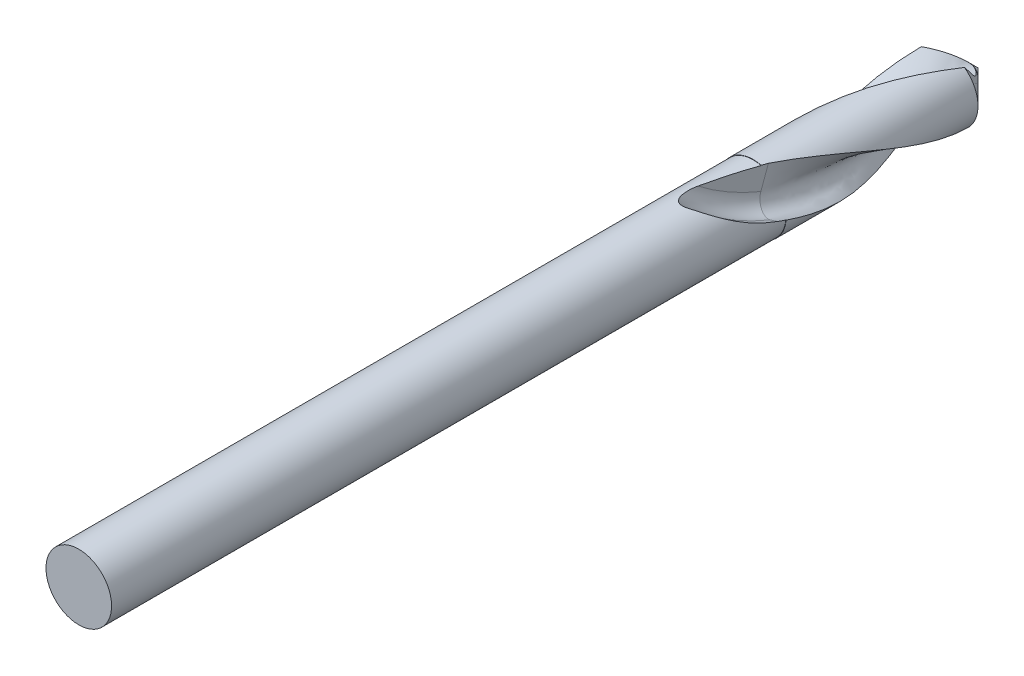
from build123d import *

# Parameters (mm, degrees)
FOPO_DENT_PITCH       = 8.63
FOPO_DENT_HEIGHT      = 3.9
FOPO_DENT_RADIUS      = 0.5
FOPO_DENT_START_ANGLE = 135
FOPO_DEG_ANGLE        = 90
REP_COUNT             = 2


with BuildPart() as part:
    # EsqCorps → CorpsOutil (revolve)
    with BuildSketch(Plane(origin=(0, 0, 0), x_dir=(0, 0, -1), z_dir=(1, 0, 0)), mode=Mode.PRIVATE) as corpsoutil_sk:
        Polygon((0, 0), (-13.6, 0), (-13.6, 0.496), (-3.4, 0.496), (-3.4, 0.5), (-0.5, 0.5), align=None)
    revolve(corpsoutil_sk.sketch.rotate(Axis((0, 0, 0.300640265), (0, 0, -1)), 180), axis=Axis((0, 0, 0.300640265), (0, 0, -1)))

    # FOPO-Dent: sweep along a helix
    with BuildLine() as fopo_dent_path:
        add(Helix(FOPO_DENT_PITCH, FOPO_DENT_HEIGHT, FOPO_DENT_RADIUS, center=(0, 0, 3.4), direction=(0, 0, -1), mode=Mode.PRIVATE).rotate(Axis((0, 0, 3.4), (0, 0, -1)), FOPO_DENT_START_ANGLE))
    # EsqDent → FOPO-Dent (sweep, cut)
    with BuildSketch(Plane(origin=(0.353553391, 0.353553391, 3.4), x_dir=(-0.9656323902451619, 0.03492966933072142, -0.25755388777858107), z_dir=(0.24188076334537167, -0.24188076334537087, -0.9396740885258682))):
        with BuildLine():
            Line((0.229053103, -0.236570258), (0.229053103, 0.618524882))
            ThreePointArc((0.229053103, 0.618524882), (-0.328822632, 0.37666394), (-0.643467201, -0.143644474))
            Line((-0.643467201, -0.143644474), (-0.05547055, -0.417831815))
            ThreePointArc((-0.05547055, -0.417831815), (0.136513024, -0.405248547), (0.229053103, -0.236570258))
        make_face()
    fopo_dent = sweep(path=fopo_dent_path.line, is_frenet=True, mode=Mode.SUBTRACT)

    # EsqDeg → FOPO-Deg (revolve, cut)
    with BuildSketch(Plane(origin=(0.353553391, 0.353553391, 3.4), x_dir=(-0.9656323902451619, 0.03492966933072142, -0.25755388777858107), z_dir=(0.24188076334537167, -0.24188076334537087, -0.9396740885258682))):
        with BuildLine():
            Line((0.229053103, -0.236570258), (0.229053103, 0.618524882))
            ThreePointArc((0.229053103, 0.618524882), (-0.328822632, 0.37666394), (-0.643467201, -0.143644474))
            Line((-0.643467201, -0.143644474), (-0.05547055, -0.417831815))
            ThreePointArc((-0.05547055, -0.417831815), (0.136513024, -0.405248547), (0.229053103, -0.236570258))
        make_face()
    fopo_deg = revolve(axis=Axis((1.696882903, 2.371413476, 3.226369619), (-0.9656323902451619, 0.034929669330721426, -0.25755388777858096)), revolution_arc=FOPO_DEG_ANGLE, mode=Mode.SUBTRACT)

    # Rep: FOPO-Dent, FOPO-Deg ×2 about axis
    rep_axis = Axis((0, 0, -1.449807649), (0, 0, 1))
    add([fopo_dent.rotate(rep_axis, i * 360 / REP_COUNT) for i in range(1, REP_COUNT)], mode=Mode.SUBTRACT)
    add([fopo_deg.rotate(rep_axis, i * 360 / REP_COUNT) for i in range(1, REP_COUNT)], mode=Mode.SUBTRACT)


solid = part.part
